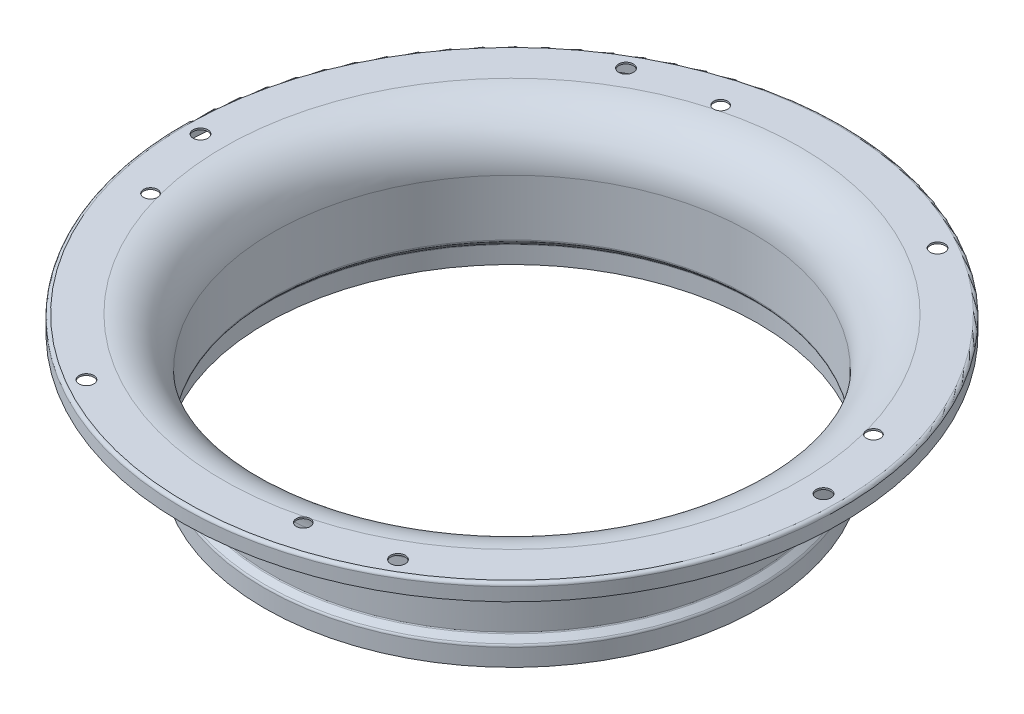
ISO-10303-21;
HEADER;
FILE_DESCRIPTION(('STEP AP214'),'2;1');
FILE_NAME('part.step','',(''),(''),'','','');
FILE_SCHEMA(('AUTOMOTIVE_DESIGN { 1 0 10303 214 1 1 1 1 }'));
ENDSEC;
DATA;
#1=APPLICATION_CONTEXT('core data for automotive mechanical design processes');
#2=APPLICATION_PROTOCOL_DEFINITION('international standard','automotive_design',2000,#1);
#3=PRODUCT_CONTEXT('',#1,'mechanical');
#4=PRODUCT('Part','Part','',(#3));
#5=PRODUCT_RELATED_PRODUCT_CATEGORY('part','',(#4));
#6=PRODUCT_DEFINITION_FORMATION('','',#4);
#7=PRODUCT_DEFINITION_CONTEXT('part definition',#1,'design');
#8=PRODUCT_DEFINITION('design','',#6,#7);
#9=PRODUCT_DEFINITION_SHAPE('','',#8);
#10=(LENGTH_UNIT() NAMED_UNIT(*) SI_UNIT(.MILLI.,.METRE.));
#11=(NAMED_UNIT(*) PLANE_ANGLE_UNIT() SI_UNIT($,.RADIAN.));
#12=(NAMED_UNIT(*) SI_UNIT($,.STERADIAN.) SOLID_ANGLE_UNIT());
#13=UNCERTAINTY_MEASURE_WITH_UNIT(LENGTH_MEASURE(1.E-05),#10,'distance_accuracy_value','');
#14=(GEOMETRIC_REPRESENTATION_CONTEXT(3) GLOBAL_UNCERTAINTY_ASSIGNED_CONTEXT((#13)) GLOBAL_UNIT_ASSIGNED_CONTEXT((#10,
#11,#12)) REPRESENTATION_CONTEXT('',''));
#15=CARTESIAN_POINT('',(0.,0.,0.));
#16=DIRECTION('',(0.,0.,1.));
#17=DIRECTION('',(1.,0.,0.));
#18=AXIS2_PLACEMENT_3D('',#15,#16,#17);
#19=CARTESIAN_POINT('',(-150.,0.,0.));
#20=DIRECTION('',(0.,1.,0.));
#21=DIRECTION('',(0.,0.,1.));
#22=AXIS2_PLACEMENT_3D('',#19,#20,#21);
#23=PLANE('',#22);
#24=CARTESIAN_POINT('',(0.,0.,0.));
#25=DIRECTION('',(0.,-1.,0.));
#26=DIRECTION('',(0.,0.,-1.));
#27=AXIS2_PLACEMENT_3D('',#24,#25,#26);
#28=CIRCLE('',#27,150.);
#29=CARTESIAN_POINT('',(0.,0.,-150.));
#30=VERTEX_POINT('',#29);
#31=EDGE_CURVE('E320',#30,#30,#28,.T.);
#32=ORIENTED_EDGE('',*,*,#31,.F.);
#33=EDGE_LOOP('',(#32));
#34=FACE_BOUND('',#33,.T.);
#35=CARTESIAN_POINT('',(0.,0.,0.));
#36=DIRECTION('',(0.,-1.,0.));
#37=DIRECTION('',(0.,0.,-1.));
#38=AXIS2_PLACEMENT_3D('',#35,#36,#37);
#39=CIRCLE('',#38,151.);
#40=CARTESIAN_POINT('',(0.,0.,-151.));
#41=VERTEX_POINT('',#40);
#42=EDGE_CURVE('E319',#41,#41,#39,.T.);
#43=ORIENTED_EDGE('',*,*,#42,.T.);
#44=EDGE_LOOP('',(#43));
#45=FACE_BOUND('',#44,.T.);
#46=ADVANCED_FACE('F38',(#34,#45),#23,.F.);
#47=CARTESIAN_POINT('',(0.,0.,0.));
#48=DIRECTION('',(0.,-1.,0.));
#49=DIRECTION('',(0.,0.,-1.));
#50=AXIS2_PLACEMENT_3D('',#47,#48,#49);
#51=CYLINDRICAL_SURFACE('',#50,150.);
#52=CARTESIAN_POINT('',(0.,10.5857864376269,0.));
#53=DIRECTION('',(0.,-1.,0.));
#54=DIRECTION('',(0.,0.,-1.));
#55=AXIS2_PLACEMENT_3D('',#52,#53,#54);
#56=CIRCLE('',#55,150.);
#57=CARTESIAN_POINT('',(0.,10.5857864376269,-150.));
#58=VERTEX_POINT('',#57);
#59=EDGE_CURVE('E324',#58,#58,#56,.T.);
#60=ORIENTED_EDGE('',*,*,#59,.F.);
#61=EDGE_LOOP('',(#60));
#62=FACE_BOUND('',#61,.T.);
#63=ORIENTED_EDGE('',*,*,#31,.T.);
#64=EDGE_LOOP('',(#63));
#65=FACE_BOUND('',#64,.T.);
#66=ADVANCED_FACE('F354',(#62,#65),#51,.F.);
#67=CARTESIAN_POINT('',(0.,10.5857864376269,0.));
#68=DIRECTION('',(0.,-1.,0.));
#69=DIRECTION('',(0.,0.,-1.));
#70=AXIS2_PLACEMENT_3D('',#67,#68,#69);
#71=TOROIDAL_SURFACE('',#70,149.,1.);
#72=CARTESIAN_POINT('',(0.,11.2928932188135,0.));
#73=DIRECTION('',(0.,-1.,0.));
#74=DIRECTION('',(0.,0.,-1.));
#75=AXIS2_PLACEMENT_3D('',#72,#73,#74);
#76=CIRCLE('',#75,149.707106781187);
#77=CARTESIAN_POINT('',(0.,11.2928932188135,-149.707106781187));
#78=VERTEX_POINT('',#77);
#79=EDGE_CURVE('E327',#78,#78,#76,.T.);
#80=ORIENTED_EDGE('',*,*,#79,.F.);
#81=EDGE_LOOP('',(#80));
#82=FACE_BOUND('',#81,.T.);
#83=ORIENTED_EDGE('',*,*,#59,.T.);
#84=EDGE_LOOP('',(#83));
#85=FACE_BOUND('',#84,.T.);
#86=ADVANCED_FACE('F348',(#82,#85),#71,.F.);
#87=CARTESIAN_POINT('',(0.,11.2928932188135,0.));
#88=DIRECTION('',(0.,-1.,0.));
#89=DIRECTION('',(0.,0.,-1.));
#90=AXIS2_PLACEMENT_3D('',#87,#88,#89);
#91=CONICAL_SURFACE('',#90,149.707106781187,0.785398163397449);
#92=CARTESIAN_POINT('',(0.,14.4142135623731,0.));
#93=DIRECTION('',(0.,-1.,0.));
#94=DIRECTION('',(0.,0.,-1.));
#95=AXIS2_PLACEMENT_3D('',#92,#93,#94);
#96=CIRCLE('',#95,146.585786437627);
#97=CARTESIAN_POINT('',(0.,14.4142135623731,-146.585786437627));
#98=VERTEX_POINT('',#97);
#99=EDGE_CURVE('E331',#98,#98,#96,.T.);
#100=ORIENTED_EDGE('',*,*,#99,.F.);
#101=EDGE_LOOP('',(#100));
#102=FACE_BOUND('',#101,.T.);
#103=ORIENTED_EDGE('',*,*,#79,.T.);
#104=EDGE_LOOP('',(#103));
#105=FACE_BOUND('',#104,.T.);
#106=ADVANCED_FACE('F343',(#102,#105),#91,.F.);
#107=CARTESIAN_POINT('',(0.,15.8284271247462,0.));
#108=DIRECTION('',(0.,-1.,0.));
#109=DIRECTION('',(0.,0.,-1.));
#110=AXIS2_PLACEMENT_3D('',#107,#108,#109);
#111=TOROIDAL_SURFACE('',#110,148.,2.);
#112=CARTESIAN_POINT('',(0.,15.8284271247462,0.));
#113=DIRECTION('',(0.,-1.,0.));
#114=DIRECTION('',(0.,0.,-1.));
#115=AXIS2_PLACEMENT_3D('',#112,#113,#114);
#116=CIRCLE('',#115,146.);
#117=CARTESIAN_POINT('',(0.,15.8284271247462,-146.));
#118=VERTEX_POINT('',#117);
#119=EDGE_CURVE('E133',#118,#118,#116,.T.);
#120=ORIENTED_EDGE('',*,*,#119,.F.);
#121=EDGE_LOOP('',(#120));
#122=FACE_BOUND('',#121,.T.);
#123=ORIENTED_EDGE('',*,*,#99,.T.);
#124=EDGE_LOOP('',(#123));
#125=FACE_BOUND('',#124,.T.);
#126=ADVANCED_FACE('F340',(#122,#125),#111,.T.);
#127=CARTESIAN_POINT('',(0.,0.,0.));
#128=DIRECTION('',(0.,-1.,0.));
#129=DIRECTION('',(0.,0.,-1.));
#130=AXIS2_PLACEMENT_3D('',#127,#128,#129);
#131=CYLINDRICAL_SURFACE('',#130,146.);
#132=CARTESIAN_POINT('',(0.,50.,0.));
#133=DIRECTION('',(0.,-1.,0.));
#134=DIRECTION('',(0.,0.,-1.));
#135=AXIS2_PLACEMENT_3D('',#132,#133,#134);
#136=CIRCLE('',#135,146.);
#137=CARTESIAN_POINT('',(0.,50.,-146.));
#138=VERTEX_POINT('',#137);
#139=EDGE_CURVE('E127',#138,#138,#136,.T.);
#140=ORIENTED_EDGE('',*,*,#139,.F.);
#141=EDGE_LOOP('',(#140));
#142=FACE_BOUND('',#141,.T.);
#143=ORIENTED_EDGE('',*,*,#119,.T.);
#144=EDGE_LOOP('',(#143));
#145=FACE_BOUND('',#144,.T.);
#146=ADVANCED_FACE('F187',(#142,#145),#131,.F.);
#147=CARTESIAN_POINT('',(0.,50.,0.));
#148=DIRECTION('',(0.,-1.,0.));
#149=DIRECTION('',(0.,0.,-1.));
#150=AXIS2_PLACEMENT_3D('',#147,#148,#149);
#151=TOROIDAL_SURFACE('',#150,176.,30.);
#152=CARTESIAN_POINT('',(0.,80.,0.));
#153=DIRECTION('',(0.,-1.,0.));
#154=DIRECTION('',(0.,0.,-1.));
#155=AXIS2_PLACEMENT_3D('',#152,#153,#154);
#156=CIRCLE('',#155,176.);
#157=CARTESIAN_POINT('',(-170.364955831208,80.,44.1789749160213));
#158=VERTEX_POINT('',#157);
#159=CARTESIAN_POINT('',(-46.922363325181,80.,-169.629867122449));
#160=VERTEX_POINT('',#159);
#161=EDGE_CURVE('E118',#158,#160,#156,.T.);
#162=ORIENTED_EDGE('',*,*,#161,.F.);
#163=CARTESIAN_POINT('',(-169.629867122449,80.,46.9223633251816));
#164=CARTESIAN_POINT('',(-169.625590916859,79.9999935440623,46.8682749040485));
#165=CARTESIAN_POINT('',(-169.622351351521,79.9999692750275,46.8141076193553));
#166=CARTESIAN_POINT('',(-169.618648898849,79.9999118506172,46.7229454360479));
#167=CARTESIAN_POINT('',(-169.617630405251,79.9998839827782,46.6859726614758));
#168=CARTESIAN_POINT('',(-169.616463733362,79.9998187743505,46.6054426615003));
#169=CARTESIAN_POINT('',(-169.616502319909,79.999780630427,46.561882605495));
#170=CARTESIAN_POINT('',(-169.618025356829,79.9996943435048,46.4682143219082));
#171=CARTESIAN_POINT('',(-169.619727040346,79.999645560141,46.4181095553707));
#172=CARTESIAN_POINT('',(-169.625241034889,79.9995368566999,46.3114295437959));
#173=CARTESIAN_POINT('',(-169.629300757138,79.9994763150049,46.2548670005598));
#174=CARTESIAN_POINT('',(-169.640141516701,79.9993506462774,46.1369306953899));
#175=CARTESIAN_POINT('',(-169.647132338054,79.9992855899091,46.075576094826));
#176=CARTESIAN_POINT('',(-169.662616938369,79.9991726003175,45.9617783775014));
#177=CARTESIAN_POINT('',(-169.670764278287,79.9991235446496,45.9092878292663));
#178=CARTESIAN_POINT('',(-169.687537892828,79.9990426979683,45.8131468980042));
#179=CARTESIAN_POINT('',(-169.695871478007,79.9990093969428,45.76944533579));
#180=CARTESIAN_POINT('',(-169.712157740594,79.9989567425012,45.6907730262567));
#181=CARTESIAN_POINT('',(-169.719870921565,79.9989359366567,45.6557525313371));
#182=CARTESIAN_POINT('',(-169.738450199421,79.9989154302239,45.5762022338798));
#183=CARTESIAN_POINT('',(-169.749596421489,79.9989232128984,45.5317378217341));
#184=CARTESIAN_POINT('',(-169.782278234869,79.9990199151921,45.4097666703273));
#185=CARTESIAN_POINT('',(-169.805305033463,79.9991656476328,45.3326542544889));
#186=CARTESIAN_POINT('',(-169.855696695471,79.9993875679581,45.1798643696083));
#187=CARTESIAN_POINT('',(-169.883061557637,79.9994637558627,45.1041869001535));
#188=CARTESIAN_POINT('',(-169.942042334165,79.9996103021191,44.9545059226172));
#189=CARTESIAN_POINT('',(-169.973658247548,79.9996806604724,44.8805024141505));
#190=CARTESIAN_POINT('',(-170.041038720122,79.9997984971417,44.7344091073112));
#191=CARTESIAN_POINT('',(-170.076803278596,79.9998459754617,44.6623193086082));
#192=CARTESIAN_POINT('',(-170.152366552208,79.9999225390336,44.5202858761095));
#193=CARTESIAN_POINT('',(-170.192165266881,79.9999516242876,44.4503422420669));
#194=CARTESIAN_POINT('',(-170.275665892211,79.9999905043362,44.3128250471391));
#195=CARTESIAN_POINT('',(-170.319367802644,80.0000002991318,44.2452514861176));
#196=CARTESIAN_POINT('',(-170.364955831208,80.,44.1789749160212));
#197=B_SPLINE_CURVE_WITH_KNOTS('',3,(#163,#164,#165,#166,#167,#168,#169,#170,#171,#172,#173,
#174,#175,#176,#177,#178,#179,#180,#181,#182,#183,#184,#185,#186,#187,#188,#189,#190,#191,#192,
#193,#194,#195,#196),.UNSPECIFIED.,.F.,.F.,(4,2,2,2,2,2,2,2,2,2,2,2,2,2,2,2,4),(0.,
0.162754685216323,0.273703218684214,0.404362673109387,0.5547323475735,0.724811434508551,
0.910005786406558,1.06932621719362,1.2027712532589,1.31033966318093,1.44783856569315,
1.6891308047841,1.93042297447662,2.17171508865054,2.41300716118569,2.65429920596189,
2.89559123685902),.UNSPECIFIED.);
#198=CARTESIAN_POINT('',(-169.629867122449,80.,46.9223633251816));
#199=VERTEX_POINT('',#198);
#200=EDGE_CURVE('E56',#199,#158,#197,.T.);
#201=ORIENTED_EDGE('',*,*,#200,.F.);
#202=CARTESIAN_POINT('',(44.1789749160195,80.,170.364955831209));
#203=VERTEX_POINT('',#202);
#204=EDGE_CURVE('E116',#203,#199,#156,.T.);
#205=ORIENTED_EDGE('',*,*,#204,.F.);
#206=CARTESIAN_POINT('',(46.9223633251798,80.,169.629867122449));
#207=CARTESIAN_POINT('',(46.8682749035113,79.9999935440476,169.625590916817));
#208=CARTESIAN_POINT('',(46.8141076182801,79.999969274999,169.622351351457));
#209=CARTESIAN_POINT('',(46.7229454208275,79.9999118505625,169.618648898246));
#210=CARTESIAN_POINT('',(46.6859726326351,79.9998839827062,169.617630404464));
#211=CARTESIAN_POINT('',(46.6054425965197,79.9998187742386,169.616463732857));
#212=CARTESIAN_POINT('',(46.5618825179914,79.9997806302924,169.616502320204));
#213=CARTESIAN_POINT('',(46.4682141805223,79.9996943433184,169.618025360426));
#214=CARTESIAN_POINT('',(46.4181093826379,79.9996455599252,169.619727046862));
#215=CARTESIAN_POINT('',(46.3114292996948,79.9995368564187,169.625241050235));
#216=CARTESIAN_POINT('',(46.2548667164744,79.9994763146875,169.629300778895));
#217=CARTESIAN_POINT('',(46.1369304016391,79.9993506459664,169.640141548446));
#218=CARTESIAN_POINT('',(46.0755758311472,79.9992855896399,169.647132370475));
#219=CARTESIAN_POINT('',(45.9617781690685,79.9991726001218,169.662616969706));
#220=CARTESIAN_POINT('',(45.9092876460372,79.9991235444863,169.670764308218));
#221=CARTESIAN_POINT('',(45.8131467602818,79.9990426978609,169.687537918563));
#222=CARTESIAN_POINT('',(45.7694452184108,79.9990093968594,169.695871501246));
#223=CARTESIAN_POINT('',(45.690772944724,79.9989567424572,169.712157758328));
#224=CARTESIAN_POINT('',(45.6557524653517,79.9989359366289,169.719870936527));
#225=CARTESIAN_POINT('',(45.576202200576,79.9989154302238,169.738450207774));
#226=CARTESIAN_POINT('',(45.53173780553,79.9989232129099,169.749596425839));
#227=CARTESIAN_POINT('',(45.4097666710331,79.9990199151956,169.782278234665));
#228=CARTESIAN_POINT('',(45.3326542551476,79.9991656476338,169.805305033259));
#229=CARTESIAN_POINT('',(45.179864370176,79.9993875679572,169.855696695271));
#230=CARTESIAN_POINT('',(45.1041869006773,79.9994637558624,169.883061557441));
#231=CARTESIAN_POINT('',(44.9545059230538,79.9996103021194,169.942042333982));
#232=CARTESIAN_POINT('',(44.8805024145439,79.9996806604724,169.973658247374));
#233=CARTESIAN_POINT('',(44.7344091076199,79.9997984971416,170.041038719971));
#234=CARTESIAN_POINT('',(44.6623193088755,79.9998459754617,170.076803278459));
#235=CARTESIAN_POINT('',(44.520285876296,79.9999225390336,170.152366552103));
#236=CARTESIAN_POINT('',(44.450342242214,79.9999516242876,170.192165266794));
#237=CARTESIAN_POINT('',(44.3128250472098,79.9999905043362,170.275665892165));
#238=CARTESIAN_POINT('',(44.2452514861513,80.0000002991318,170.31936780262));
#239=CARTESIAN_POINT('',(44.1789749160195,80.,170.364955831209));
#240=B_SPLINE_CURVE_WITH_KNOTS('',3,(#206,#207,#208,#209,#210,#211,#212,#213,#214,#215,#216,
#217,#218,#219,#220,#221,#222,#223,#224,#225,#226,#227,#228,#229,#230,#231,#232,#233,#234,#235,
#236,#237,#238,#239),.UNSPECIFIED.,.F.,.F.,(4,2,2,2,2,2,2,2,2,2,2,2,2,2,2,2,4),(0.,
0.162754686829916,0.273703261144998,0.404362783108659,0.554732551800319,0.72481175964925,
0.910006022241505,1.0693263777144,1.20277135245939,1.3103397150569,1.44783856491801,
1.68913080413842,1.9304229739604,2.17171508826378,2.41300716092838,2.65429920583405,
2.89559123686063),.UNSPECIFIED.);
#241=CARTESIAN_POINT('',(46.9223633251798,80.,169.629867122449));
#242=VERTEX_POINT('',#241);
#243=EDGE_CURVE('E275',#242,#203,#240,.T.);
#244=ORIENTED_EDGE('',*,*,#243,.F.);
#245=CARTESIAN_POINT('',(170.364955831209,80.,-44.1789749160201));
#246=VERTEX_POINT('',#245);
#247=EDGE_CURVE('E158',#246,#242,#156,.T.);
#248=ORIENTED_EDGE('',*,*,#247,.F.);
#249=CARTESIAN_POINT('',(169.629867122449,80.,-46.9223633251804));
#250=CARTESIAN_POINT('',(169.625590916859,79.9999935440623,-46.8682749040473));
#251=CARTESIAN_POINT('',(169.622351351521,79.9999692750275,-46.8141076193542));
#252=CARTESIAN_POINT('',(169.618648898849,79.9999118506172,-46.7229454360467));
#253=CARTESIAN_POINT('',(169.617630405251,79.9998839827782,-46.6859726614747));
#254=CARTESIAN_POINT('',(169.616463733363,79.9998187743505,-46.6054426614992));
#255=CARTESIAN_POINT('',(169.616502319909,79.999780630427,-46.5618826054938));
#256=CARTESIAN_POINT('',(169.61802535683,79.9996943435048,-46.4682143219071));
#257=CARTESIAN_POINT('',(169.619727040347,79.999645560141,-46.4181095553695));
#258=CARTESIAN_POINT('',(169.625241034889,79.9995368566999,-46.3114295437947));
#259=CARTESIAN_POINT('',(169.629300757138,79.9994763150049,-46.2548670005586));
#260=CARTESIAN_POINT('',(169.640141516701,79.9993506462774,-46.1369306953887));
#261=CARTESIAN_POINT('',(169.647132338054,79.9992855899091,-46.0755760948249));
#262=CARTESIAN_POINT('',(169.662616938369,79.9991726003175,-45.9617783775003));
#263=CARTESIAN_POINT('',(169.670764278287,79.9991235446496,-45.9092878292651));
#264=CARTESIAN_POINT('',(169.687537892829,79.9990426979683,-45.813146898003));
#265=CARTESIAN_POINT('',(169.695871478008,79.9990093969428,-45.7694453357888));
#266=CARTESIAN_POINT('',(169.712157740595,79.9989567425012,-45.6907730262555));
#267=CARTESIAN_POINT('',(169.719870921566,79.9989359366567,-45.6557525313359));
#268=CARTESIAN_POINT('',(169.738450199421,79.9989154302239,-45.5762022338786));
#269=CARTESIAN_POINT('',(169.749596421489,79.9989232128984,-45.5317378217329));
#270=CARTESIAN_POINT('',(169.782278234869,79.9990199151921,-45.4097666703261));
#271=CARTESIAN_POINT('',(169.805305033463,79.9991656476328,-45.3326542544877));
#272=CARTESIAN_POINT('',(169.855696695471,79.9993875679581,-45.1798643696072));
#273=CARTESIAN_POINT('',(169.883061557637,79.9994637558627,-45.1041869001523));
#274=CARTESIAN_POINT('',(169.942042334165,79.9996103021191,-44.954505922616));
#275=CARTESIAN_POINT('',(169.973658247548,79.9996806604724,-44.8805024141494));
#276=CARTESIAN_POINT('',(170.041038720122,79.9997984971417,-44.73440910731));
#277=CARTESIAN_POINT('',(170.076803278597,79.9998459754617,-44.6623193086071));
#278=CARTESIAN_POINT('',(170.152366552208,79.9999225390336,-44.5202858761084));
#279=CARTESIAN_POINT('',(170.192165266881,79.9999516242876,-44.4503422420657));
#280=CARTESIAN_POINT('',(170.275665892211,79.9999905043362,-44.3128250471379));
#281=CARTESIAN_POINT('',(170.319367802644,80.0000002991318,-44.2452514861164));
#282=CARTESIAN_POINT('',(170.364955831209,80.,-44.1789749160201));
#283=B_SPLINE_CURVE_WITH_KNOTS('',3,(#249,#250,#251,#252,#253,#254,#255,#256,#257,#258,#259,
#260,#261,#262,#263,#264,#265,#266,#267,#268,#269,#270,#271,#272,#273,#274,#275,#276,#277,#278,
#279,#280,#281,#282),.UNSPECIFIED.,.F.,.F.,(4,2,2,2,2,2,2,2,2,2,2,2,2,2,2,2,4),(0.,
0.162754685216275,0.273703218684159,0.404362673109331,0.554732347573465,0.724811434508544,
0.910005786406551,1.06932621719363,1.20277125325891,1.31033966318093,1.44783856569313,
1.68913080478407,1.93042297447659,2.1717150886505,2.41300716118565,2.65429920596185,
2.89559123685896),.UNSPECIFIED.);
#284=CARTESIAN_POINT('',(169.629867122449,80.,-46.9223633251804));
#285=VERTEX_POINT('',#284);
#286=EDGE_CURVE('E202',#285,#246,#283,.T.);
#287=ORIENTED_EDGE('',*,*,#286,.F.);
#288=CARTESIAN_POINT('',(-44.1789749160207,80.,-170.364955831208));
#289=VERTEX_POINT('',#288);
#290=EDGE_CURVE('E136',#289,#285,#156,.T.);
#291=ORIENTED_EDGE('',*,*,#290,.F.);
#292=CARTESIAN_POINT('',(-46.922363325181,80.,-169.629867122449));
#293=CARTESIAN_POINT('',(-46.8456875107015,80.0000034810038,-169.623805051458));
#294=CARTESIAN_POINT('',(-46.768863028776,79.999966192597,-169.619827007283));
#295=CARTESIAN_POINT('',(-46.6571428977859,79.9998861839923,-169.617077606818));
#296=CARTESIAN_POINT('',(-46.6222858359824,79.9998575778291,-169.61664872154));
#297=CARTESIAN_POINT('',(-46.5424860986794,79.9997886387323,-169.616648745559));
#298=CARTESIAN_POINT('',(-46.4975429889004,79.9997473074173,-169.617361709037));
#299=CARTESIAN_POINT('',(-46.410595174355,79.9996691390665,-169.620120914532));
#300=CARTESIAN_POINT('',(-46.3685875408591,79.9996321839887,-169.622078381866));
#301=CARTESIAN_POINT('',(-46.2637300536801,79.9995400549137,-169.628525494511));
#302=CARTESIAN_POINT('',(-46.2009259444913,79.9994849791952,-169.633790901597));
#303=CARTESIAN_POINT('',(-46.0834358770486,79.9993833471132,-169.646277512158));
#304=CARTESIAN_POINT('',(-46.0287148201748,79.9993365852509,-169.653172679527));
#305=CARTESIAN_POINT('',(-45.9273626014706,79.999251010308,-169.667952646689));
#306=CARTESIAN_POINT('',(-45.8806904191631,79.9992120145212,-169.675556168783));
#307=CARTESIAN_POINT('',(-45.7953659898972,79.999143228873,-169.690922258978));
#308=CARTESIAN_POINT('',(-45.7566707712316,79.9991129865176,-169.698448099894));
#309=CARTESIAN_POINT('',(-45.6640099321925,79.9990403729,-169.71781153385));
#310=CARTESIAN_POINT('',(-45.6101508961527,79.9989980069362,-169.73016712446));
#311=CARTESIAN_POINT('',(-45.5334766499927,79.9989608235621,-169.749337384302));
#312=CARTESIAN_POINT('',(-45.5104445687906,79.9989526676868,-169.755301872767));
#313=CARTESIAN_POINT('',(-45.4097703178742,79.9989774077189,-169.782277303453));
#314=CARTESIAN_POINT('',(-45.3326552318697,79.9991542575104,-169.805304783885));
#315=CARTESIAN_POINT('',(-45.1798633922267,79.9993989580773,-169.855696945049));
#316=CARTESIAN_POINT('',(-45.1041866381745,79.9994668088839,-169.883061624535));
#317=CARTESIAN_POINT('',(-44.9545061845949,79.9996072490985,-169.942042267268));
#318=CARTESIAN_POINT('',(-44.8805024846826,79.9996798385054,-169.973658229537));
#319=CARTESIAN_POINT('',(-44.734409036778,79.9997993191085,-170.041038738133));
#320=CARTESIAN_POINT('',(-44.6623192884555,79.9998462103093,-170.076803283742));
#321=CARTESIAN_POINT('',(-44.5202858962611,79.9999223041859,-170.152366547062));
#322=CARTESIAN_POINT('',(-44.4503422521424,79.9999515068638,-170.192165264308));
#323=CARTESIAN_POINT('',(-44.3128250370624,79.99999062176,-170.275665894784));
#324=CARTESIAN_POINT('',(-44.2452514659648,80.0000005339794,-170.31936780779));
#325=CARTESIAN_POINT('',(-44.1789749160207,80.,-170.364955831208));
#326=B_SPLINE_CURVE_WITH_KNOTS('',3,(#292,#293,#294,#295,#296,#297,#298,#299,#300,#301,#302,
#303,#304,#305,#306,#307,#308,#309,#310,#311,#312,#313,#314,#315,#316,#317,#318,#319,#320,#321,
#322,#323,#324,#325),.UNSPECIFIED.,.F.,.F.,(4,2,2,2,2,2,2,2,2,2,2,2,2,2,2,2,4),(0.,
0.230682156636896,0.335251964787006,0.470073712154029,0.596217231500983,0.785222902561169,
0.950643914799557,1.09247899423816,1.21072704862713,1.37645090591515,1.44782526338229,
1.68911750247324,1.93040967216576,2.17170178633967,2.41299385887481,2.65428590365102,
2.89557793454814),.UNSPECIFIED.);
#327=EDGE_CURVE('E171',#160,#289,#326,.T.);
#328=ORIENTED_EDGE('',*,*,#327,.F.);
#329=EDGE_LOOP('',(#162,#201,#205,#244,#248,#287,#291,#328));
#330=FACE_BOUND('',#329,.T.);
#331=ORIENTED_EDGE('',*,*,#139,.T.);
#332=EDGE_LOOP('',(#331));
#333=FACE_BOUND('',#332,.T.);
#334=ADVANCED_FACE('F113',(#330,#333),#151,.T.);
#335=CARTESIAN_POINT('',(-176.,80.,0.));
#336=DIRECTION('',(0.,-1.,0.));
#337=DIRECTION('',(0.,0.,-1.));
#338=AXIS2_PLACEMENT_3D('',#335,#336,#337);
#339=PLANE('',#338);
#340=CARTESIAN_POINT('',(-95.0000000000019,80.,-164.544826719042));
#341=DIRECTION('',(0.,1.,0.));
#342=DIRECTION('',(0.,0.,1.));
#343=AXIS2_PLACEMENT_3D('',#340,#341,#342);
#344=CIRCLE('',#343,4.49999999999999);
#345=CARTESIAN_POINT('',(-95.0000000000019,80.,-160.044826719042));
#346=VERTEX_POINT('',#345);
#347=EDGE_CURVE('E270',#346,#346,#344,.T.);
#348=ORIENTED_EDGE('',*,*,#347,.F.);
#349=EDGE_LOOP('',(#348));
#350=FACE_BOUND('',#349,.T.);
#351=CARTESIAN_POINT('',(94.9999999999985,80.,-164.544826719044));
#352=DIRECTION('',(0.,1.,0.));
#353=DIRECTION('',(0.,0.,1.));
#354=AXIS2_PLACEMENT_3D('',#351,#352,#353);
#355=CIRCLE('',#354,4.49999999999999);
#356=CARTESIAN_POINT('',(94.9999999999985,80.,-160.044826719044));
#357=VERTEX_POINT('',#356);
#358=EDGE_CURVE('E288',#357,#357,#355,.T.);
#359=ORIENTED_EDGE('',*,*,#358,.F.);
#360=EDGE_LOOP('',(#359));
#361=FACE_BOUND('',#360,.T.);
#362=CARTESIAN_POINT('',(190.,80.,-1.32676367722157E-12));
#363=DIRECTION('',(0.,1.,0.));
#364=DIRECTION('',(0.,0.,1.));
#365=AXIS2_PLACEMENT_3D('',#362,#363,#364);
#366=CIRCLE('',#365,4.5);
#367=CARTESIAN_POINT('',(190.,80.,4.49999999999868));
#368=VERTEX_POINT('',#367);
#369=EDGE_CURVE('E300',#368,#368,#366,.T.);
#370=ORIENTED_EDGE('',*,*,#369,.F.);
#371=EDGE_LOOP('',(#370));
#372=FACE_BOUND('',#371,.T.);
#373=CARTESIAN_POINT('',(95.0000000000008,80.,164.544826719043));
#374=DIRECTION('',(0.,1.,0.));
#375=DIRECTION('',(0.,0.,1.));
#376=AXIS2_PLACEMENT_3D('',#373,#374,#375);
#377=CIRCLE('',#376,4.49999999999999);
#378=CARTESIAN_POINT('',(95.0000000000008,80.,169.044826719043));
#379=VERTEX_POINT('',#378);
#380=EDGE_CURVE('E304',#379,#379,#377,.T.);
#381=ORIENTED_EDGE('',*,*,#380,.F.);
#382=EDGE_LOOP('',(#381));
#383=FACE_BOUND('',#382,.T.);
#384=CARTESIAN_POINT('',(-94.9999999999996,80.,164.544826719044));
#385=DIRECTION('',(0.,1.,0.));
#386=DIRECTION('',(0.,0.,1.));
#387=AXIS2_PLACEMENT_3D('',#384,#385,#386);
#388=CIRCLE('',#387,4.49999999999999);
#389=CARTESIAN_POINT('',(-94.9999999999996,80.,169.044826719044));
#390=VERTEX_POINT('',#389);
#391=EDGE_CURVE('E309',#390,#390,#388,.T.);
#392=ORIENTED_EDGE('',*,*,#391,.F.);
#393=EDGE_LOOP('',(#392));
#394=FACE_BOUND('',#393,.T.);
#395=CARTESIAN_POINT('',(-190.,80.,0.));
#396=DIRECTION('',(0.,1.,0.));
#397=DIRECTION('',(0.,0.,1.));
#398=AXIS2_PLACEMENT_3D('',#395,#396,#397);
#399=CIRCLE('',#398,4.5);
#400=CARTESIAN_POINT('',(-190.,80.,4.5));
#401=VERTEX_POINT('',#400);
#402=EDGE_CURVE('E314',#401,#401,#399,.T.);
#403=ORIENTED_EDGE('',*,*,#402,.F.);
#404=EDGE_LOOP('',(#403));
#405=FACE_BOUND('',#404,.T.);
#406=CARTESIAN_POINT('',(0.,80.,0.));
#407=DIRECTION('',(0.,-1.,0.));
#408=DIRECTION('',(0.,0.,-1.));
#409=AXIS2_PLACEMENT_3D('',#406,#407,#408);
#410=CIRCLE('',#409,199.);
#411=CARTESIAN_POINT('',(0.,80.,-199.));
#412=VERTEX_POINT('',#411);
#413=EDGE_CURVE('E152',#412,#412,#410,.T.);
#414=ORIENTED_EDGE('',*,*,#413,.F.);
#415=EDGE_LOOP('',(#414));
#416=FACE_BOUND('',#415,.T.);
#417=ORIENTED_EDGE('',*,*,#204,.T.);
#418=CARTESIAN_POINT('',(-173.866648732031,80.,46.5874281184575));
#419=DIRECTION('',(0.,1.,0.));
#420=DIRECTION('',(0.,0.,1.));
#421=AXIS2_PLACEMENT_3D('',#418,#419,#420);
#422=CIRCLE('',#421,4.25);
#423=EDGE_CURVE('E104',#158,#199,#422,.T.);
#424=ORIENTED_EDGE('',*,*,#423,.F.);
#425=ORIENTED_EDGE('',*,*,#161,.T.);
#426=CARTESIAN_POINT('',(-46.5874281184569,80.,-173.866648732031));
#427=DIRECTION('',(0.,1.,0.));
#428=DIRECTION('',(0.,0.,1.));
#429=AXIS2_PLACEMENT_3D('',#426,#427,#428);
#430=CIRCLE('',#429,4.24999999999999);
#431=EDGE_CURVE('E120',#289,#160,#430,.T.);
#432=ORIENTED_EDGE('',*,*,#431,.F.);
#433=ORIENTED_EDGE('',*,*,#290,.T.);
#434=CARTESIAN_POINT('',(173.866648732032,80.,-46.5874281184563));
#435=DIRECTION('',(0.,1.,0.));
#436=DIRECTION('',(0.,0.,1.));
#437=AXIS2_PLACEMENT_3D('',#434,#435,#436);
#438=CIRCLE('',#437,4.25);
#439=EDGE_CURVE('E216',#246,#285,#438,.T.);
#440=ORIENTED_EDGE('',*,*,#439,.F.);
#441=ORIENTED_EDGE('',*,*,#247,.T.);
#442=CARTESIAN_POINT('',(46.5874281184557,80.,173.866648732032));
#443=DIRECTION('',(0.,1.,0.));
#444=DIRECTION('',(0.,0.,1.));
#445=AXIS2_PLACEMENT_3D('',#442,#443,#444);
#446=CIRCLE('',#445,4.24999999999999);
#447=EDGE_CURVE('E125',#203,#242,#446,.T.);
#448=ORIENTED_EDGE('',*,*,#447,.F.);
#449=EDGE_LOOP('',(#417,#424,#425,#432,#433,#440,#441,#448));
#450=FACE_BOUND('',#449,.T.);
#451=ADVANCED_FACE('F123',(#350,#361,#372,#383,#394,#405,#416,#450),#339,.F.);
#452=CARTESIAN_POINT('',(0.,78.,0.));
#453=DIRECTION('',(0.,-1.,0.));
#454=DIRECTION('',(0.,0.,-1.));
#455=AXIS2_PLACEMENT_3D('',#452,#453,#454);
#456=TOROIDAL_SURFACE('',#455,199.,2.);
#457=CARTESIAN_POINT('',(0.,78.,0.));
#458=DIRECTION('',(0.,-1.,0.));
#459=DIRECTION('',(0.,0.,-1.));
#460=AXIS2_PLACEMENT_3D('',#457,#458,#459);
#461=CIRCLE('',#460,201.);
#462=CARTESIAN_POINT('',(0.,78.,-201.));
#463=VERTEX_POINT('',#462);
#464=EDGE_CURVE('E411',#463,#463,#461,.T.);
#465=ORIENTED_EDGE('',*,*,#464,.F.);
#466=EDGE_LOOP('',(#465));
#467=FACE_BOUND('',#466,.T.);
#468=ORIENTED_EDGE('',*,*,#413,.T.);
#469=EDGE_LOOP('',(#468));
#470=FACE_BOUND('',#469,.T.);
#471=ADVANCED_FACE('F473',(#467,#470),#456,.T.);
#472=CARTESIAN_POINT('',(0.,0.,0.));
#473=DIRECTION('',(0.,-1.,0.));
#474=DIRECTION('',(0.,0.,-1.));
#475=AXIS2_PLACEMENT_3D('',#472,#473,#474);
#476=CYLINDRICAL_SURFACE('',#475,201.);
#477=CARTESIAN_POINT('',(0.,70.,0.));
#478=DIRECTION('',(0.,-1.,0.));
#479=DIRECTION('',(0.,0.,-1.));
#480=AXIS2_PLACEMENT_3D('',#477,#478,#479);
#481=CIRCLE('',#480,201.);
#482=CARTESIAN_POINT('',(0.,70.,-201.));
#483=VERTEX_POINT('',#482);
#484=EDGE_CURVE('E409',#483,#483,#481,.T.);
#485=ORIENTED_EDGE('',*,*,#484,.F.);
#486=EDGE_LOOP('',(#485));
#487=FACE_BOUND('',#486,.T.);
#488=ORIENTED_EDGE('',*,*,#464,.T.);
#489=EDGE_LOOP('',(#488));
#490=FACE_BOUND('',#489,.T.);
#491=ADVANCED_FACE('F513',(#487,#490),#476,.T.);
#492=CARTESIAN_POINT('',(-201.,70.,0.));
#493=DIRECTION('',(0.,1.,0.));
#494=DIRECTION('',(0.,0.,1.));
#495=AXIS2_PLACEMENT_3D('',#492,#493,#494);
#496=PLANE('',#495);
#497=CARTESIAN_POINT('',(0.,70.,0.));
#498=DIRECTION('',(0.,-1.,0.));
#499=DIRECTION('',(0.,0.,-1.));
#500=AXIS2_PLACEMENT_3D('',#497,#498,#499);
#501=CIRCLE('',#500,200.);
#502=CARTESIAN_POINT('',(0.,70.,-200.));
#503=VERTEX_POINT('',#502);
#504=EDGE_CURVE('E405',#503,#503,#501,.T.);
#505=ORIENTED_EDGE('',*,*,#504,.F.);
#506=EDGE_LOOP('',(#505));
#507=FACE_BOUND('',#506,.T.);
#508=ORIENTED_EDGE('',*,*,#484,.T.);
#509=EDGE_LOOP('',(#508));
#510=FACE_BOUND('',#509,.T.);
#511=ADVANCED_FACE('F509',(#507,#510),#496,.F.);
#512=CARTESIAN_POINT('',(0.,0.,0.));
#513=DIRECTION('',(0.,-1.,0.));
#514=DIRECTION('',(0.,0.,-1.));
#515=AXIS2_PLACEMENT_3D('',#512,#513,#514);
#516=CYLINDRICAL_SURFACE('',#515,200.);
#517=CARTESIAN_POINT('',(0.,78.,0.));
#518=DIRECTION('',(0.,-1.,0.));
#519=DIRECTION('',(0.,0.,-1.));
#520=AXIS2_PLACEMENT_3D('',#517,#518,#519);
#521=CIRCLE('',#520,200.);
#522=CARTESIAN_POINT('',(0.,78.,-200.));
#523=VERTEX_POINT('',#522);
#524=EDGE_CURVE('E401',#523,#523,#521,.T.);
#525=ORIENTED_EDGE('',*,*,#524,.F.);
#526=EDGE_LOOP('',(#525));
#527=FACE_BOUND('',#526,.T.);
#528=ORIENTED_EDGE('',*,*,#504,.T.);
#529=EDGE_LOOP('',(#528));
#530=FACE_BOUND('',#529,.T.);
#531=ADVANCED_FACE('F500',(#527,#530),#516,.F.);
#532=CARTESIAN_POINT('',(0.,78.,0.));
#533=DIRECTION('',(0.,-1.,0.));
#534=DIRECTION('',(0.,0.,-1.));
#535=AXIS2_PLACEMENT_3D('',#532,#533,#534);
#536=TOROIDAL_SURFACE('',#535,199.,1.);
#537=CARTESIAN_POINT('',(0.,79.,0.));
#538=DIRECTION('',(0.,-1.,0.));
#539=DIRECTION('',(0.,0.,-1.));
#540=AXIS2_PLACEMENT_3D('',#537,#538,#539);
#541=CIRCLE('',#540,199.);
#542=CARTESIAN_POINT('',(0.,79.,-199.));
#543=VERTEX_POINT('',#542);
#544=EDGE_CURVE('E396',#543,#543,#541,.T.);
#545=ORIENTED_EDGE('',*,*,#544,.F.);
#546=EDGE_LOOP('',(#545));
#547=FACE_BOUND('',#546,.T.);
#548=ORIENTED_EDGE('',*,*,#524,.T.);
#549=EDGE_LOOP('',(#548));
#550=FACE_BOUND('',#549,.T.);
#551=ADVANCED_FACE('F492',(#547,#550),#536,.F.);
#552=CARTESIAN_POINT('',(-176.,79.,0.));
#553=DIRECTION('',(0.,1.,0.));
#554=DIRECTION('',(0.,0.,1.));
#555=AXIS2_PLACEMENT_3D('',#552,#553,#554);
#556=PLANE('',#555);
#557=CARTESIAN_POINT('',(-95.0000000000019,79.,-164.544826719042));
#558=DIRECTION('',(0.,1.,0.));
#559=DIRECTION('',(0.,0.,1.));
#560=AXIS2_PLACEMENT_3D('',#557,#558,#559);
#561=CIRCLE('',#560,4.49999999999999);
#562=CARTESIAN_POINT('',(-95.0000000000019,79.,-160.044826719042));
#563=VERTEX_POINT('',#562);
#564=EDGE_CURVE('E283',#563,#563,#561,.T.);
#565=ORIENTED_EDGE('',*,*,#564,.T.);
#566=EDGE_LOOP('',(#565));
#567=FACE_BOUND('',#566,.T.);
#568=CARTESIAN_POINT('',(94.9999999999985,79.,-164.544826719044));
#569=DIRECTION('',(0.,1.,0.));
#570=DIRECTION('',(0.,0.,1.));
#571=AXIS2_PLACEMENT_3D('',#568,#569,#570);
#572=CIRCLE('',#571,4.49999999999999);
#573=CARTESIAN_POINT('',(94.9999999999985,79.,-160.044826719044));
#574=VERTEX_POINT('',#573);
#575=EDGE_CURVE('E295',#574,#574,#572,.T.);
#576=ORIENTED_EDGE('',*,*,#575,.T.);
#577=EDGE_LOOP('',(#576));
#578=FACE_BOUND('',#577,.T.);
#579=CARTESIAN_POINT('',(190.,79.,-1.32676367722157E-12));
#580=DIRECTION('',(0.,1.,0.));
#581=DIRECTION('',(0.,0.,1.));
#582=AXIS2_PLACEMENT_3D('',#579,#580,#581);
#583=CIRCLE('',#582,4.49999999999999);
#584=CARTESIAN_POINT('',(190.,79.,4.49999999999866));
#585=VERTEX_POINT('',#584);
#586=EDGE_CURVE('E301',#585,#585,#583,.T.);
#587=ORIENTED_EDGE('',*,*,#586,.T.);
#588=EDGE_LOOP('',(#587));
#589=FACE_BOUND('',#588,.T.);
#590=CARTESIAN_POINT('',(95.0000000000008,79.,164.544826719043));
#591=DIRECTION('',(0.,1.,0.));
#592=DIRECTION('',(0.,0.,1.));
#593=AXIS2_PLACEMENT_3D('',#590,#591,#592);
#594=CIRCLE('',#593,4.49999999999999);
#595=CARTESIAN_POINT('',(95.0000000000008,79.,169.044826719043));
#596=VERTEX_POINT('',#595);
#597=EDGE_CURVE('E305',#596,#596,#594,.T.);
#598=ORIENTED_EDGE('',*,*,#597,.T.);
#599=EDGE_LOOP('',(#598));
#600=FACE_BOUND('',#599,.T.);
#601=CARTESIAN_POINT('',(-94.9999999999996,79.,164.544826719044));
#602=DIRECTION('',(0.,1.,0.));
#603=DIRECTION('',(0.,0.,1.));
#604=AXIS2_PLACEMENT_3D('',#601,#602,#603);
#605=CIRCLE('',#604,4.49999999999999);
#606=CARTESIAN_POINT('',(-94.9999999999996,79.,169.044826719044));
#607=VERTEX_POINT('',#606);
#608=EDGE_CURVE('E310',#607,#607,#605,.T.);
#609=ORIENTED_EDGE('',*,*,#608,.T.);
#610=EDGE_LOOP('',(#609));
#611=FACE_BOUND('',#610,.T.);
#612=CARTESIAN_POINT('',(-190.,79.,0.));
#613=DIRECTION('',(0.,1.,0.));
#614=DIRECTION('',(0.,0.,1.));
#615=AXIS2_PLACEMENT_3D('',#612,#613,#614);
#616=CIRCLE('',#615,4.49999999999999);
#617=CARTESIAN_POINT('',(-190.,79.,4.49999999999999));
#618=VERTEX_POINT('',#617);
#619=EDGE_CURVE('E315',#618,#618,#616,.T.);
#620=ORIENTED_EDGE('',*,*,#619,.T.);
#621=EDGE_LOOP('',(#620));
#622=FACE_BOUND('',#621,.T.);
#623=CARTESIAN_POINT('',(0.,79.,0.));
#624=DIRECTION('',(0.,-1.,0.));
#625=DIRECTION('',(0.,0.,-1.));
#626=AXIS2_PLACEMENT_3D('',#623,#624,#625);
#627=CIRCLE('',#626,176.);
#628=CARTESIAN_POINT('',(-170.364955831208,79.,44.178974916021));
#629=VERTEX_POINT('',#628);
#630=CARTESIAN_POINT('',(-46.9223633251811,79.,-169.629867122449));
#631=VERTEX_POINT('',#630);
#632=EDGE_CURVE('E397',#629,#631,#627,.T.);
#633=ORIENTED_EDGE('',*,*,#632,.F.);
#634=CARTESIAN_POINT('',(-173.866648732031,79.,46.5874281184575));
#635=DIRECTION('',(0.,1.,0.));
#636=DIRECTION('',(0.,0.,1.));
#637=AXIS2_PLACEMENT_3D('',#634,#635,#636);
#638=CIRCLE('',#637,4.24999999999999);
#639=CARTESIAN_POINT('',(-169.629867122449,79.,46.9223633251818));
#640=VERTEX_POINT('',#639);
#641=EDGE_CURVE('E64',#629,#640,#638,.T.);
#642=ORIENTED_EDGE('',*,*,#641,.T.);
#643=CARTESIAN_POINT('',(44.1789749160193,79.,170.364955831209));
#644=VERTEX_POINT('',#643);
#645=EDGE_CURVE('E392',#644,#640,#627,.T.);
#646=ORIENTED_EDGE('',*,*,#645,.F.);
#647=CARTESIAN_POINT('',(46.5874281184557,79.,173.866648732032));
#648=DIRECTION('',(0.,1.,0.));
#649=DIRECTION('',(0.,0.,1.));
#650=AXIS2_PLACEMENT_3D('',#647,#648,#649);
#651=CIRCLE('',#650,4.24999999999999);
#652=CARTESIAN_POINT('',(46.92236332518,79.,169.629867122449));
#653=VERTEX_POINT('',#652);
#654=EDGE_CURVE('E212',#644,#653,#651,.T.);
#655=ORIENTED_EDGE('',*,*,#654,.T.);
#656=CARTESIAN_POINT('',(170.364955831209,79.,-44.1789749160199));
#657=VERTEX_POINT('',#656);
#658=EDGE_CURVE('E391',#657,#653,#627,.T.);
#659=ORIENTED_EDGE('',*,*,#658,.F.);
#660=CARTESIAN_POINT('',(173.866648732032,79.,-46.5874281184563));
#661=DIRECTION('',(0.,1.,0.));
#662=DIRECTION('',(0.,0.,1.));
#663=AXIS2_PLACEMENT_3D('',#660,#661,#662);
#664=CIRCLE('',#663,4.24999999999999);
#665=CARTESIAN_POINT('',(169.629867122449,79.,-46.9223633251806));
#666=VERTEX_POINT('',#665);
#667=EDGE_CURVE('E208',#657,#666,#664,.T.);
#668=ORIENTED_EDGE('',*,*,#667,.T.);
#669=CARTESIAN_POINT('',(-44.1789749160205,79.,-170.364955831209));
#670=VERTEX_POINT('',#669);
#671=EDGE_CURVE('E447',#670,#666,#627,.T.);
#672=ORIENTED_EDGE('',*,*,#671,.F.);
#673=CARTESIAN_POINT('',(-46.5874281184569,79.,-173.866648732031));
#674=DIRECTION('',(0.,1.,0.));
#675=DIRECTION('',(0.,0.,1.));
#676=AXIS2_PLACEMENT_3D('',#673,#674,#675);
#677=CIRCLE('',#676,4.24999999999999);
#678=EDGE_CURVE('E424',#670,#631,#677,.T.);
#679=ORIENTED_EDGE('',*,*,#678,.T.);
#680=EDGE_LOOP('',(#633,#642,#646,#655,#659,#668,#672,#679));
#681=FACE_BOUND('',#680,.T.);
#682=ORIENTED_EDGE('',*,*,#544,.T.);
#683=EDGE_LOOP('',(#682));
#684=FACE_BOUND('',#683,.T.);
#685=ADVANCED_FACE('F445',(#567,#578,#589,#600,#611,#622,#681,#684),#556,.F.);
#686=CARTESIAN_POINT('',(0.,50.,0.));
#687=DIRECTION('',(0.,-1.,0.));
#688=DIRECTION('',(0.,0.,-1.));
#689=AXIS2_PLACEMENT_3D('',#686,#687,#688);
#690=TOROIDAL_SURFACE('',#689,176.,29.);
#691=CARTESIAN_POINT('',(0.,50.,0.));
#692=DIRECTION('',(0.,-1.,0.));
#693=DIRECTION('',(0.,0.,-1.));
#694=AXIS2_PLACEMENT_3D('',#691,#692,#693);
#695=CIRCLE('',#694,147.);
#696=CARTESIAN_POINT('',(0.,50.,-147.));
#697=VERTEX_POINT('',#696);
#698=EDGE_CURVE('E388',#697,#697,#695,.T.);
#699=ORIENTED_EDGE('',*,*,#698,.F.);
#700=EDGE_LOOP('',(#699));
#701=FACE_BOUND('',#700,.T.);
#702=ORIENTED_EDGE('',*,*,#645,.T.);
#703=CARTESIAN_POINT('',(-176.0002,78.1333305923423,50.2630857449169));
#704=CARTESIAN_POINT('',(-175.895116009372,78.154415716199,50.3240920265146));
#705=CARTESIAN_POINT('',(-175.787491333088,78.1760035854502,50.3805281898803));
#706=CARTESIAN_POINT('',(-175.567929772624,78.2198403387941,50.4839457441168));
#707=CARTESIAN_POINT('',(-175.455993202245,78.2420891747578,50.5309278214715));
#708=CARTESIAN_POINT('',(-175.228585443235,78.2869018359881,50.6151227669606));
#709=CARTESIAN_POINT('',(-175.113115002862,78.3094655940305,50.6523376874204));
#710=CARTESIAN_POINT('',(-174.879448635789,78.3545753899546,50.7167675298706));
#711=CARTESIAN_POINT('',(-174.761252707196,78.3771214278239,50.7439824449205));
#712=CARTESIAN_POINT('',(-174.403662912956,78.4442727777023,50.8103152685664));
#713=CARTESIAN_POINT('',(-174.161150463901,78.4884146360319,50.834164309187));
#714=CARTESIAN_POINT('',(-173.675170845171,78.5730630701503,50.8400675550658));
#715=CARTESIAN_POINT('',(-173.431703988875,78.6135707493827,50.8221344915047));
#716=CARTESIAN_POINT('',(-172.951785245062,78.6890287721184,50.7448620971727));
#717=CARTESIAN_POINT('',(-172.71530411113,78.7240061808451,50.6857325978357));
#718=CARTESIAN_POINT('',(-172.255133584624,78.7874956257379,50.5275691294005));
#719=CARTESIAN_POINT('',(-172.031444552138,78.816007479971,50.428534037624));
#720=CARTESIAN_POINT('',(-171.608065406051,78.8656082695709,50.19554549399));
#721=CARTESIAN_POINT('',(-171.407983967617,78.8868346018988,50.0623321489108));
#722=CARTESIAN_POINT('',(-171.032790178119,78.922871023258,49.7637793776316));
#723=CARTESIAN_POINT('',(-170.857674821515,78.9376818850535,49.5984438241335));
#724=CARTESIAN_POINT('',(-170.53958284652,78.9615451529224,49.2425052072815));
#725=CARTESIAN_POINT('',(-170.396250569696,78.9706636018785,49.0522241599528));
#726=CARTESIAN_POINT('',(-170.143284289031,78.9845807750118,48.6503003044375));
#727=CARTESIAN_POINT('',(-170.033651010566,78.9893794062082,48.4386570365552));
#728=CARTESIAN_POINT('',(-169.851141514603,78.9960131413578,47.9997816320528));
#729=CARTESIAN_POINT('',(-169.778303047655,78.9978452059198,47.7725337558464));
#730=CARTESIAN_POINT('',(-169.671615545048,78.9998691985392,47.3090564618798));
#731=CARTESIAN_POINT('',(-169.637767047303,79.0000611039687,47.072826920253));
#732=CARTESIAN_POINT('',(-169.609959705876,78.9999097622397,46.5970955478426));
#733=CARTESIAN_POINT('',(-169.616158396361,78.9995644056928,46.3575844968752));
#734=CARTESIAN_POINT('',(-169.668640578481,78.9990556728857,45.8829948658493));
#735=CARTESIAN_POINT('',(-169.71492426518,78.9988922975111,45.6479163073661));
#736=CARTESIAN_POINT('',(-169.846326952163,78.9989631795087,45.1886370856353));
#737=CARTESIAN_POINT('',(-169.931482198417,78.9991978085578,44.9644467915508));
#738=CARTESIAN_POINT('',(-170.138222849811,78.9997424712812,44.5335423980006));
#739=CARTESIAN_POINT('',(-170.259808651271,79.0000525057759,44.3268284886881));
#740=CARTESIAN_POINT('',(-170.535962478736,78.999933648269,43.9367419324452));
#741=CARTESIAN_POINT('',(-170.690531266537,78.9995047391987,43.7533698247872));
#742=CARTESIAN_POINT('',(-171.028254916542,78.9967236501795,43.4151852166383));
#743=CARTESIAN_POINT('',(-171.211409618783,78.9943714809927,43.2603725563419));
#744=CARTESIAN_POINT('',(-171.600868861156,78.9863720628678,42.9838580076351));
#745=CARTESIAN_POINT('',(-171.807149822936,78.980728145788,42.862122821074));
#746=CARTESIAN_POINT('',(-172.237050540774,78.9647974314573,42.6550207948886));
#747=CARTESIAN_POINT('',(-172.460669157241,78.9545109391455,42.5696515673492));
#748=CARTESIAN_POINT('',(-172.917782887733,78.928242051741,42.4379098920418));
#749=CARTESIAN_POINT('',(-173.151233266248,78.9122834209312,42.3913774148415));
#750=CARTESIAN_POINT('',(-173.622155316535,78.8739943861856,42.3378542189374));
#751=CARTESIAN_POINT('',(-173.859627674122,78.8516628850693,42.3308703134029));
#752=CARTESIAN_POINT('',(-174.331621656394,78.8005498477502,42.3563313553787));
#753=CARTESIAN_POINT('',(-174.566144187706,78.7717703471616,42.3887638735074));
#754=CARTESIAN_POINT('',(-175.025696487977,78.7082865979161,42.4917679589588));
#755=CARTESIAN_POINT('',(-175.250735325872,78.6735881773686,42.5623021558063));
#756=CARTESIAN_POINT('',(-175.559715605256,78.6208637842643,42.6879535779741));
#757=CARTESIAN_POINT('',(-175.65015549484,78.6047684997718,42.7284875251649));
#758=CARTESIAN_POINT('',(-175.82770359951,78.5718759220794,42.8156244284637));
#759=CARTESIAN_POINT('',(-175.914818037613,78.5550800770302,42.8622152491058));
#760=CARTESIAN_POINT('',(-176.0002,78.5379717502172,42.9117704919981));
#761=B_SPLINE_CURVE_WITH_KNOTS('',3,(#703,#704,#705,#706,#707,#708,#709,#710,#711,#712,#713,
#714,#715,#716,#717,#718,#719,#720,#721,#722,#723,#724,#725,#726,#727,#728,#729,#730,#731,#732,
#733,#734,#735,#736,#737,#738,#739,#740,#741,#742,#743,#744,#745,#746,#747,#748,#749,#750,#751,
#752,#753,#754,#755,#756,#757,#758,#759,#760),.UNSPECIFIED.,.F.,.F.,(4,2,2,2,2,2,2,2,2,2,2,2,2,
2,2,2,2,2,2,2,2,2,2,2,2,2,2,2,4),(0.,0.36984717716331,0.739667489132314,1.10941003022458,
1.47915282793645,2.21826385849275,2.95714970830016,3.69229934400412,4.42746966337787,
5.1478963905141,5.86823631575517,6.58005553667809,7.29189007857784,8.00445346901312,
8.71702669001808,9.43240467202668,10.1477861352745,10.8638360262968,11.5798937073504,
12.2959679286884,13.0120381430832,13.7273848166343,14.4426845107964,15.1550220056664,
15.8674822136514,16.5797178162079,17.2912561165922,17.5922800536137,17.8927099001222),.UNSPECIFIED.);
#762=EDGE_CURVE('E11',#640,#629,#761,.T.);
#763=ORIENTED_EDGE('',*,*,#762,.T.);
#764=ORIENTED_EDGE('',*,*,#632,.T.);
#765=CARTESIAN_POINT('',(-50.2630857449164,78.1333305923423,-176.0002));
#766=CARTESIAN_POINT('',(-50.324092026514,78.1544157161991,-175.895116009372));
#767=CARTESIAN_POINT('',(-50.3805281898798,78.1760035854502,-175.787491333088));
#768=CARTESIAN_POINT('',(-50.4839457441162,78.2198403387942,-175.567929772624));
#769=CARTESIAN_POINT('',(-50.5309278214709,78.2420891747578,-175.455993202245));
#770=CARTESIAN_POINT('',(-50.61512276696,78.2869018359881,-175.228585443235));
#771=CARTESIAN_POINT('',(-50.6523376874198,78.3094655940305,-175.113115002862));
#772=CARTESIAN_POINT('',(-50.71676752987,78.3545753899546,-174.879448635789));
#773=CARTESIAN_POINT('',(-50.74398244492,78.377121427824,-174.761252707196));
#774=CARTESIAN_POINT('',(-50.8103152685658,78.4442727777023,-174.403662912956));
#775=CARTESIAN_POINT('',(-50.8341643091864,78.488414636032,-174.161150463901));
#776=CARTESIAN_POINT('',(-50.8400675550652,78.5730630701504,-173.675170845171));
#777=CARTESIAN_POINT('',(-50.8221344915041,78.6135707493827,-173.431703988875));
#778=CARTESIAN_POINT('',(-50.7448620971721,78.6890287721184,-172.951785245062));
#779=CARTESIAN_POINT('',(-50.6857325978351,78.7240061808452,-172.71530411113));
#780=CARTESIAN_POINT('',(-50.5275691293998,78.787495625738,-172.255133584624));
#781=CARTESIAN_POINT('',(-50.4285340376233,78.816007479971,-172.031444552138));
#782=CARTESIAN_POINT('',(-50.1955454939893,78.8656082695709,-171.608065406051));
#783=CARTESIAN_POINT('',(-50.0623321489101,78.8868346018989,-171.407983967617));
#784=CARTESIAN_POINT('',(-49.7637793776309,78.922871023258,-171.032790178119));
#785=CARTESIAN_POINT('',(-49.5984438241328,78.9376818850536,-170.857674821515));
#786=CARTESIAN_POINT('',(-49.2425052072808,78.9615451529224,-170.53958284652));
#787=CARTESIAN_POINT('',(-49.052224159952,78.9706636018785,-170.396250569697));
#788=CARTESIAN_POINT('',(-48.6503003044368,78.9845807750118,-170.143284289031));
#789=CARTESIAN_POINT('',(-48.4386570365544,78.9893794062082,-170.033651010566));
#790=CARTESIAN_POINT('',(-47.9997816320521,78.9960131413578,-169.851141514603));
#791=CARTESIAN_POINT('',(-47.7725337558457,78.9978452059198,-169.778303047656));
#792=CARTESIAN_POINT('',(-47.3090564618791,78.9998691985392,-169.671615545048));
#793=CARTESIAN_POINT('',(-47.0728269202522,79.0000611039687,-169.637767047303));
#794=CARTESIAN_POINT('',(-46.5970955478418,78.9999097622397,-169.609959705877));
#795=CARTESIAN_POINT('',(-46.3575844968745,78.9995644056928,-169.616158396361));
#796=CARTESIAN_POINT('',(-45.8829948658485,78.9990556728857,-169.668640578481));
#797=CARTESIAN_POINT('',(-45.6479163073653,78.9988922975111,-169.71492426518));
#798=CARTESIAN_POINT('',(-45.1886370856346,78.9989631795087,-169.846326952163));
#799=CARTESIAN_POINT('',(-44.96444679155,78.9991978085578,-169.931482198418));
#800=CARTESIAN_POINT('',(-44.5335423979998,78.9997424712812,-170.138222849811));
#801=CARTESIAN_POINT('',(-44.3268284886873,79.0000525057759,-170.259808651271));
#802=CARTESIAN_POINT('',(-43.9367419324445,78.999933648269,-170.535962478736));
#803=CARTESIAN_POINT('',(-43.7533698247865,78.9995047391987,-170.690531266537));
#804=CARTESIAN_POINT('',(-43.4151852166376,78.9967236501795,-171.028254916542));
#805=CARTESIAN_POINT('',(-43.2603725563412,78.9943714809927,-171.211409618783));
#806=CARTESIAN_POINT('',(-42.9838580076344,78.9863720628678,-171.600868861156));
#807=CARTESIAN_POINT('',(-42.8621228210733,78.980728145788,-171.807149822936));
#808=CARTESIAN_POINT('',(-42.6550207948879,78.9647974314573,-172.237050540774));
#809=CARTESIAN_POINT('',(-42.5696515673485,78.9545109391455,-172.460669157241));
#810=CARTESIAN_POINT('',(-42.4379098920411,78.928242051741,-172.917782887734));
#811=CARTESIAN_POINT('',(-42.3913774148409,78.9122834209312,-173.151233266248));
#812=CARTESIAN_POINT('',(-42.3378542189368,78.8739943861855,-173.622155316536));
#813=CARTESIAN_POINT('',(-42.3308703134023,78.8516628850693,-173.859627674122));
#814=CARTESIAN_POINT('',(-42.3563313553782,78.8005498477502,-174.331621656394));
#815=CARTESIAN_POINT('',(-42.3887638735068,78.7717703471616,-174.566144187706));
#816=CARTESIAN_POINT('',(-42.4917679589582,78.7082865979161,-175.025696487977));
#817=CARTESIAN_POINT('',(-42.5623021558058,78.6735881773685,-175.250735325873));
#818=CARTESIAN_POINT('',(-42.6879535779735,78.6208637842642,-175.559715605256));
#819=CARTESIAN_POINT('',(-42.7284875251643,78.6047684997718,-175.650155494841));
#820=CARTESIAN_POINT('',(-42.8156244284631,78.5718759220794,-175.82770359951));
#821=CARTESIAN_POINT('',(-42.8622152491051,78.5550800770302,-175.914818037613));
#822=CARTESIAN_POINT('',(-42.9117704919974,78.5379717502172,-176.0002));
#823=B_SPLINE_CURVE_WITH_KNOTS('',3,(#765,#766,#767,#768,#769,#770,#771,#772,#773,#774,#775,
#776,#777,#778,#779,#780,#781,#782,#783,#784,#785,#786,#787,#788,#789,#790,#791,#792,#793,#794,
#795,#796,#797,#798,#799,#800,#801,#802,#803,#804,#805,#806,#807,#808,#809,#810,#811,#812,#813,
#814,#815,#816,#817,#818,#819,#820,#821,#822),.UNSPECIFIED.,.F.,.F.,(4,2,2,2,2,2,2,2,2,2,2,2,2,
2,2,2,2,2,2,2,2,2,2,2,2,2,2,2,4),(0.,0.369847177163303,0.739667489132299,1.10941003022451,
1.4791528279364,2.2182638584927,2.95714970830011,3.69229934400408,4.42746966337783,
5.14789639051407,5.86823631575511,6.58005553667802,7.2918900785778,8.00445346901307,
8.71702669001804,9.43240467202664,10.1477861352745,10.8638360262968,11.5798937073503,
12.2959679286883,13.0120381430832,13.7273848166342,14.4426845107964,15.1550220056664,
15.8674822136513,16.5797178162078,17.2912561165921,17.5922800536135,17.8927099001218),.UNSPECIFIED.);
#824=EDGE_CURVE('E49',#631,#670,#823,.T.);
#825=ORIENTED_EDGE('',*,*,#824,.T.);
#826=ORIENTED_EDGE('',*,*,#671,.T.);
#827=CARTESIAN_POINT('',(176.0002,78.1333305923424,-50.2630857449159));
#828=CARTESIAN_POINT('',(175.895116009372,78.1544157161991,-50.3240920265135));
#829=CARTESIAN_POINT('',(175.787491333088,78.1760035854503,-50.3805281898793));
#830=CARTESIAN_POINT('',(175.567929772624,78.2198403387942,-50.4839457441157));
#831=CARTESIAN_POINT('',(175.455993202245,78.2420891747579,-50.5309278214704));
#832=CARTESIAN_POINT('',(175.228585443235,78.2869018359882,-50.6151227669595));
#833=CARTESIAN_POINT('',(175.113115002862,78.3094655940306,-50.6523376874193));
#834=CARTESIAN_POINT('',(174.879448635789,78.3545753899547,-50.7167675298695));
#835=CARTESIAN_POINT('',(174.761252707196,78.377121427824,-50.7439824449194));
#836=CARTESIAN_POINT('',(174.403662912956,78.4442727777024,-50.8103152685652));
#837=CARTESIAN_POINT('',(174.161150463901,78.488414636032,-50.8341643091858));
#838=CARTESIAN_POINT('',(173.675170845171,78.5730630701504,-50.8400675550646));
#839=CARTESIAN_POINT('',(173.431703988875,78.6135707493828,-50.8221344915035));
#840=CARTESIAN_POINT('',(172.951785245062,78.6890287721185,-50.7448620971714));
#841=CARTESIAN_POINT('',(172.71530411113,78.7240061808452,-50.6857325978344));
#842=CARTESIAN_POINT('',(172.255133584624,78.787495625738,-50.5275691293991));
#843=CARTESIAN_POINT('',(172.031444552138,78.816007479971,-50.4285340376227));
#844=CARTESIAN_POINT('',(171.608065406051,78.8656082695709,-50.1955454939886));
#845=CARTESIAN_POINT('',(171.407983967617,78.8868346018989,-50.0623321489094));
#846=CARTESIAN_POINT('',(171.032790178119,78.922871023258,-49.7637793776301));
#847=CARTESIAN_POINT('',(170.857674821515,78.9376818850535,-49.598443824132));
#848=CARTESIAN_POINT('',(170.53958284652,78.9615451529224,-49.24250520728));
#849=CARTESIAN_POINT('',(170.396250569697,78.9706636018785,-49.0522241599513));
#850=CARTESIAN_POINT('',(170.143284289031,78.9845807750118,-48.650300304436));
#851=CARTESIAN_POINT('',(170.033651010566,78.9893794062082,-48.4386570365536));
#852=CARTESIAN_POINT('',(169.851141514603,78.9960131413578,-47.9997816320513));
#853=CARTESIAN_POINT('',(169.778303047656,78.9978452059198,-47.7725337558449));
#854=CARTESIAN_POINT('',(169.671615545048,78.9998691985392,-47.3090564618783));
#855=CARTESIAN_POINT('',(169.637767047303,79.0000611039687,-47.0728269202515));
#856=CARTESIAN_POINT('',(169.609959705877,78.9999097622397,-46.597095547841));
#857=CARTESIAN_POINT('',(169.616158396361,78.9995644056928,-46.3575844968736));
#858=CARTESIAN_POINT('',(169.668640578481,78.9990556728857,-45.8829948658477));
#859=CARTESIAN_POINT('',(169.714924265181,78.9988922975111,-45.6479163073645));
#860=CARTESIAN_POINT('',(169.846326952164,78.9989631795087,-45.1886370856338));
#861=CARTESIAN_POINT('',(169.931482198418,78.9991978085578,-44.9644467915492));
#862=CARTESIAN_POINT('',(170.138222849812,78.9997424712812,-44.5335423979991));
#863=CARTESIAN_POINT('',(170.259808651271,79.0000525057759,-44.3268284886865));
#864=CARTESIAN_POINT('',(170.535962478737,78.999933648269,-43.9367419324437));
#865=CARTESIAN_POINT('',(170.690531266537,78.9995047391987,-43.7533698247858));
#866=CARTESIAN_POINT('',(171.028254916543,78.9967236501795,-43.4151852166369));
#867=CARTESIAN_POINT('',(171.211409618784,78.9943714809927,-43.2603725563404));
#868=CARTESIAN_POINT('',(171.600868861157,78.9863720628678,-42.9838580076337));
#869=CARTESIAN_POINT('',(171.807149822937,78.980728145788,-42.8621228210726));
#870=CARTESIAN_POINT('',(172.237050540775,78.9647974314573,-42.6550207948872));
#871=CARTESIAN_POINT('',(172.460669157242,78.9545109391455,-42.5696515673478));
#872=CARTESIAN_POINT('',(172.917782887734,78.928242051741,-42.4379098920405));
#873=CARTESIAN_POINT('',(173.151233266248,78.9122834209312,-42.3913774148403));
#874=CARTESIAN_POINT('',(173.622155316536,78.8739943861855,-42.3378542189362));
#875=CARTESIAN_POINT('',(173.859627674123,78.8516628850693,-42.3308703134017));
#876=CARTESIAN_POINT('',(174.331621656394,78.8005498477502,-42.3563313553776));
#877=CARTESIAN_POINT('',(174.566144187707,78.7717703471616,-42.3887638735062));
#878=CARTESIAN_POINT('',(175.025696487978,78.7082865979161,-42.4917679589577));
#879=CARTESIAN_POINT('',(175.250735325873,78.6735881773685,-42.5623021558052));
#880=CARTESIAN_POINT('',(175.559715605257,78.6208637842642,-42.6879535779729));
#881=CARTESIAN_POINT('',(175.650155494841,78.6047684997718,-42.7284875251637));
#882=CARTESIAN_POINT('',(175.82770359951,78.5718759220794,-42.8156244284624));
#883=CARTESIAN_POINT('',(175.914818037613,78.5550800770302,-42.8622152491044));
#884=CARTESIAN_POINT('',(176.0002,78.5379717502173,-42.9117704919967));
#885=B_SPLINE_CURVE_WITH_KNOTS('',3,(#827,#828,#829,#830,#831,#832,#833,#834,#835,#836,#837,
#838,#839,#840,#841,#842,#843,#844,#845,#846,#847,#848,#849,#850,#851,#852,#853,#854,#855,#856,
#857,#858,#859,#860,#861,#862,#863,#864,#865,#866,#867,#868,#869,#870,#871,#872,#873,#874,#875,
#876,#877,#878,#879,#880,#881,#882,#883,#884),.UNSPECIFIED.,.F.,.F.,(4,2,2,2,2,2,2,2,2,2,2,2,2,
2,2,2,2,2,2,2,2,2,2,2,2,2,2,2,4),(0.,0.369847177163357,0.739667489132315,1.10941003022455,
1.47915282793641,2.2182638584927,2.95714970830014,3.69229934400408,4.42746966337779,
5.14789639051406,5.86823631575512,6.58005553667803,7.29189007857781,8.00445346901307,
8.71702669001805,9.43240467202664,10.1477861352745,10.8638360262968,11.5798937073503,
12.2959679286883,13.0120381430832,13.7273848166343,14.4426845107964,15.1550220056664,
15.8674822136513,16.5797178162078,17.2912561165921,17.5922800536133,17.8927099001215),.UNSPECIFIED.);
#886=EDGE_CURVE('E143',#666,#657,#885,.T.);
#887=ORIENTED_EDGE('',*,*,#886,.T.);
#888=ORIENTED_EDGE('',*,*,#658,.T.);
#889=CARTESIAN_POINT('',(50.2630857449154,78.1333305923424,176.0002));
#890=CARTESIAN_POINT('',(50.324092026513,78.1544157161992,175.895116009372));
#891=CARTESIAN_POINT('',(50.3805281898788,78.1760035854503,175.787491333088));
#892=CARTESIAN_POINT('',(50.4839457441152,78.2198403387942,175.567929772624));
#893=CARTESIAN_POINT('',(50.5309278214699,78.2420891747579,175.455993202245));
#894=CARTESIAN_POINT('',(50.6151227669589,78.2869018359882,175.228585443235));
#895=CARTESIAN_POINT('',(50.6523376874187,78.3094655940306,175.113115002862));
#896=CARTESIAN_POINT('',(50.7167675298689,78.3545753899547,174.879448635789));
#897=CARTESIAN_POINT('',(50.7439824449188,78.377121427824,174.761252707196));
#898=CARTESIAN_POINT('',(50.8103152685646,78.4442727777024,174.403662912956));
#899=CARTESIAN_POINT('',(50.8341643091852,78.488414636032,174.161150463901));
#900=CARTESIAN_POINT('',(50.8400675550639,78.5730630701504,173.675170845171));
#901=CARTESIAN_POINT('',(50.8221344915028,78.6135707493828,173.431703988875));
#902=CARTESIAN_POINT('',(50.7448620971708,78.6890287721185,172.951785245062));
#903=CARTESIAN_POINT('',(50.6857325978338,78.7240061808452,172.71530411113));
#904=CARTESIAN_POINT('',(50.5275691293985,78.787495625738,172.255133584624));
#905=CARTESIAN_POINT('',(50.428534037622,78.8160074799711,172.031444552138));
#906=CARTESIAN_POINT('',(50.1955454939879,78.8656082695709,171.608065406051));
#907=CARTESIAN_POINT('',(50.0623321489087,78.8868346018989,171.407983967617));
#908=CARTESIAN_POINT('',(49.7637793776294,78.922871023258,171.03279017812));
#909=CARTESIAN_POINT('',(49.5984438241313,78.9376818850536,170.857674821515));
#910=CARTESIAN_POINT('',(49.2425052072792,78.9615451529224,170.53958284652));
#911=CARTESIAN_POINT('',(49.0522241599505,78.9706636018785,170.396250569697));
#912=CARTESIAN_POINT('',(48.6503003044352,78.9845807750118,170.143284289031));
#913=CARTESIAN_POINT('',(48.4386570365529,78.9893794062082,170.033651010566));
#914=CARTESIAN_POINT('',(47.9997816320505,78.9960131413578,169.851141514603));
#915=CARTESIAN_POINT('',(47.7725337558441,78.9978452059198,169.778303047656));
#916=CARTESIAN_POINT('',(47.3090564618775,78.9998691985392,169.671615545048));
#917=CARTESIAN_POINT('',(47.0728269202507,79.0000611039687,169.637767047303));
#918=CARTESIAN_POINT('',(46.5970955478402,78.9999097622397,169.609959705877));
#919=CARTESIAN_POINT('',(46.3575844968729,78.9995644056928,169.616158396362));
#920=CARTESIAN_POINT('',(45.8829948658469,78.9990556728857,169.668640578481));
#921=CARTESIAN_POINT('',(45.6479163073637,78.9988922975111,169.714924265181));
#922=CARTESIAN_POINT('',(45.188637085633,78.9989631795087,169.846326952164));
#923=CARTESIAN_POINT('',(44.9644467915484,78.9991978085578,169.931482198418));
#924=CARTESIAN_POINT('',(44.5335423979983,78.9997424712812,170.138222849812));
#925=CARTESIAN_POINT('',(44.3268284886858,79.0000525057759,170.259808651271));
#926=CARTESIAN_POINT('',(43.936741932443,78.999933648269,170.535962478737));
#927=CARTESIAN_POINT('',(43.753369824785,78.9995047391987,170.690531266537));
#928=CARTESIAN_POINT('',(43.4151852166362,78.9967236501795,171.028254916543));
#929=CARTESIAN_POINT('',(43.2603725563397,78.9943714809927,171.211409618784));
#930=CARTESIAN_POINT('',(42.983858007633,78.9863720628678,171.600868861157));
#931=CARTESIAN_POINT('',(42.8621228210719,78.980728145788,171.807149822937));
#932=CARTESIAN_POINT('',(42.6550207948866,78.9647974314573,172.237050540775));
#933=CARTESIAN_POINT('',(42.5696515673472,78.9545109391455,172.460669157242));
#934=CARTESIAN_POINT('',(42.4379098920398,78.928242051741,172.917782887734));
#935=CARTESIAN_POINT('',(42.3913774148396,78.9122834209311,173.151233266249));
#936=CARTESIAN_POINT('',(42.3378542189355,78.8739943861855,173.622155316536));
#937=CARTESIAN_POINT('',(42.3308703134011,78.8516628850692,173.859627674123));
#938=CARTESIAN_POINT('',(42.356331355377,78.8005498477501,174.331621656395));
#939=CARTESIAN_POINT('',(42.3887638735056,78.7717703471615,174.566144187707));
#940=CARTESIAN_POINT('',(42.4917679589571,78.7082865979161,175.025696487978));
#941=CARTESIAN_POINT('',(42.5623021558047,78.6735881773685,175.250735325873));
#942=CARTESIAN_POINT('',(42.6879535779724,78.6208637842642,175.559715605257));
#943=CARTESIAN_POINT('',(42.7284875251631,78.6047684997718,175.650155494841));
#944=CARTESIAN_POINT('',(42.8156244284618,78.5718759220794,175.82770359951));
#945=CARTESIAN_POINT('',(42.8622152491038,78.5550800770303,175.914818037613));
#946=CARTESIAN_POINT('',(42.911770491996,78.5379717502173,176.0002));
#947=B_SPLINE_CURVE_WITH_KNOTS('',3,(#889,#890,#891,#892,#893,#894,#895,#896,#897,#898,#899,
#900,#901,#902,#903,#904,#905,#906,#907,#908,#909,#910,#911,#912,#913,#914,#915,#916,#917,#918,
#919,#920,#921,#922,#923,#924,#925,#926,#927,#928,#929,#930,#931,#932,#933,#934,#935,#936,#937,
#938,#939,#940,#941,#942,#943,#944,#945,#946),.UNSPECIFIED.,.F.,.F.,(4,2,2,2,2,2,2,2,2,2,2,2,2,
2,2,2,2,2,2,2,2,2,2,2,2,2,2,2,4),(0.,0.369847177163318,0.739667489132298,1.10941003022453,
1.47915282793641,2.2182638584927,2.95714970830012,3.69229934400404,4.42746966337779,
5.14789639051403,5.86823631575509,6.58005553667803,7.29189007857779,8.00445346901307,
8.71702669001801,9.43240467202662,10.1477861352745,10.8638360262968,11.5798937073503,
12.2959679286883,13.0120381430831,13.7273848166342,14.4426845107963,15.1550220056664,
15.8674822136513,16.5797178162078,17.2912561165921,17.592280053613,17.8927099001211),.UNSPECIFIED.);
#948=EDGE_CURVE('E254',#653,#644,#947,.T.);
#949=ORIENTED_EDGE('',*,*,#948,.T.);
#950=EDGE_LOOP('',(#702,#763,#764,#825,#826,#887,#888,#949));
#951=FACE_BOUND('',#950,.T.);
#952=ADVANCED_FACE('F455',(#701,#951),#690,.F.);
#953=CARTESIAN_POINT('',(0.,0.,0.));
#954=DIRECTION('',(0.,-1.,0.));
#955=DIRECTION('',(0.,0.,-1.));
#956=AXIS2_PLACEMENT_3D('',#953,#954,#955);
#957=CYLINDRICAL_SURFACE('',#956,147.);
#958=CARTESIAN_POINT('',(0.,15.8284271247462,0.));
#959=DIRECTION('',(0.,-1.,0.));
#960=DIRECTION('',(0.,0.,-1.));
#961=AXIS2_PLACEMENT_3D('',#958,#959,#960);
#962=CIRCLE('',#961,147.);
#963=CARTESIAN_POINT('',(0.,15.8284271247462,-147.));
#964=VERTEX_POINT('',#963);
#965=EDGE_CURVE('E384',#964,#964,#962,.T.);
#966=ORIENTED_EDGE('',*,*,#965,.F.);
#967=EDGE_LOOP('',(#966));
#968=FACE_BOUND('',#967,.T.);
#969=ORIENTED_EDGE('',*,*,#698,.T.);
#970=EDGE_LOOP('',(#969));
#971=FACE_BOUND('',#970,.T.);
#972=ADVANCED_FACE('F498',(#968,#971),#957,.T.);
#973=CARTESIAN_POINT('',(0.,15.8284271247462,0.));
#974=DIRECTION('',(0.,-1.,0.));
#975=DIRECTION('',(0.,0.,-1.));
#976=AXIS2_PLACEMENT_3D('',#973,#974,#975);
#977=TOROIDAL_SURFACE('',#976,148.,1.);
#978=CARTESIAN_POINT('',(0.,15.1213203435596,0.));
#979=DIRECTION('',(0.,-1.,0.));
#980=DIRECTION('',(0.,0.,-1.));
#981=AXIS2_PLACEMENT_3D('',#978,#979,#980);
#982=CIRCLE('',#981,147.292893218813);
#983=CARTESIAN_POINT('',(0.,15.1213203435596,-147.292893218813));
#984=VERTEX_POINT('',#983);
#985=EDGE_CURVE('E380',#984,#984,#982,.T.);
#986=ORIENTED_EDGE('',*,*,#985,.F.);
#987=EDGE_LOOP('',(#986));
#988=FACE_BOUND('',#987,.T.);
#989=ORIENTED_EDGE('',*,*,#965,.T.);
#990=EDGE_LOOP('',(#989));
#991=FACE_BOUND('',#990,.T.);
#992=ADVANCED_FACE('F552',(#988,#991),#977,.F.);
#993=CARTESIAN_POINT('',(0.,15.1213203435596,0.));
#994=DIRECTION('',(0.,-1.,0.));
#995=DIRECTION('',(0.,0.,-1.));
#996=AXIS2_PLACEMENT_3D('',#993,#994,#995);
#997=CONICAL_SURFACE('',#996,147.292893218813,0.785398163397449);
#998=CARTESIAN_POINT('',(0.,12.,0.));
#999=DIRECTION('',(0.,-1.,0.));
#1000=DIRECTION('',(0.,0.,-1.));
#1001=AXIS2_PLACEMENT_3D('',#998,#999,#1000);
#1002=CIRCLE('',#1001,150.414213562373);
#1003=CARTESIAN_POINT('',(0.,12.,-150.414213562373));
#1004=VERTEX_POINT('',#1003);
#1005=EDGE_CURVE('E372',#1004,#1004,#1002,.T.);
#1006=ORIENTED_EDGE('',*,*,#1005,.F.);
#1007=EDGE_LOOP('',(#1006));
#1008=FACE_BOUND('',#1007,.T.);
#1009=ORIENTED_EDGE('',*,*,#985,.T.);
#1010=EDGE_LOOP('',(#1009));
#1011=FACE_BOUND('',#1010,.T.);
#1012=ADVANCED_FACE('F560',(#1008,#1011),#997,.T.);
#1013=CARTESIAN_POINT('',(0.,10.5857864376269,0.));
#1014=DIRECTION('',(0.,-1.,0.));
#1015=DIRECTION('',(0.,0.,-1.));
#1016=AXIS2_PLACEMENT_3D('',#1013,#1014,#1015);
#1017=TOROIDAL_SURFACE('',#1016,149.,2.);
#1018=CARTESIAN_POINT('',(0.,10.5857864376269,0.));
#1019=DIRECTION('',(0.,-1.,0.));
#1020=DIRECTION('',(0.,0.,-1.));
#1021=AXIS2_PLACEMENT_3D('',#1018,#1019,#1020);
#1022=CIRCLE('',#1021,151.);
#1023=CARTESIAN_POINT('',(0.,10.5857864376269,-151.));
#1024=VERTEX_POINT('',#1023);
#1025=EDGE_CURVE('E368',#1024,#1024,#1022,.T.);
#1026=ORIENTED_EDGE('',*,*,#1025,.F.);
#1027=EDGE_LOOP('',(#1026));
#1028=FACE_BOUND('',#1027,.T.);
#1029=ORIENTED_EDGE('',*,*,#1005,.T.);
#1030=EDGE_LOOP('',(#1029));
#1031=FACE_BOUND('',#1030,.T.);
#1032=ADVANCED_FACE('F569',(#1028,#1031),#1017,.T.);
#1033=CARTESIAN_POINT('',(0.,0.,0.));
#1034=DIRECTION('',(0.,-1.,0.));
#1035=DIRECTION('',(0.,0.,-1.));
#1036=AXIS2_PLACEMENT_3D('',#1033,#1034,#1035);
#1037=CYLINDRICAL_SURFACE('',#1036,151.);
#1038=ORIENTED_EDGE('',*,*,#42,.F.);
#1039=EDGE_LOOP('',(#1038));
#1040=FACE_BOUND('',#1039,.T.);
#1041=ORIENTED_EDGE('',*,*,#1025,.T.);
#1042=EDGE_LOOP('',(#1041));
#1043=FACE_BOUND('',#1042,.T.);
#1044=ADVANCED_FACE('F487',(#1040,#1043),#1037,.T.);
#1045=CARTESIAN_POINT('',(-190.,80.,0.));
#1046=DIRECTION('',(0.,1.,0.));
#1047=DIRECTION('',(0.,0.,1.));
#1048=AXIS2_PLACEMENT_3D('',#1045,#1046,#1047);
#1049=CYLINDRICAL_SURFACE('',#1048,4.49999999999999);
#1050=ORIENTED_EDGE('',*,*,#402,.T.);
#1051=EDGE_LOOP('',(#1050));
#1052=FACE_BOUND('',#1051,.T.);
#1053=ORIENTED_EDGE('',*,*,#619,.F.);
#1054=EDGE_LOOP('',(#1053));
#1055=FACE_BOUND('',#1054,.T.);
#1056=ADVANCED_FACE('F483',(#1052,#1055),#1049,.F.);
#1057=CARTESIAN_POINT('',(-94.9999999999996,80.,164.544826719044));
#1058=DIRECTION('',(0.,1.,0.));
#1059=DIRECTION('',(0.,0.,1.));
#1060=AXIS2_PLACEMENT_3D('',#1057,#1058,#1059);
#1061=CYLINDRICAL_SURFACE('',#1060,4.49999999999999);
#1062=ORIENTED_EDGE('',*,*,#391,.T.);
#1063=EDGE_LOOP('',(#1062));
#1064=FACE_BOUND('',#1063,.T.);
#1065=ORIENTED_EDGE('',*,*,#608,.F.);
#1066=EDGE_LOOP('',(#1065));
#1067=FACE_BOUND('',#1066,.T.);
#1068=ADVANCED_FACE('F486',(#1064,#1067),#1061,.F.);
#1069=CARTESIAN_POINT('',(95.0000000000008,80.,164.544826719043));
#1070=DIRECTION('',(0.,1.,0.));
#1071=DIRECTION('',(0.,0.,1.));
#1072=AXIS2_PLACEMENT_3D('',#1069,#1070,#1071);
#1073=CYLINDRICAL_SURFACE('',#1072,4.49999999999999);
#1074=ORIENTED_EDGE('',*,*,#380,.T.);
#1075=EDGE_LOOP('',(#1074));
#1076=FACE_BOUND('',#1075,.T.);
#1077=ORIENTED_EDGE('',*,*,#597,.F.);
#1078=EDGE_LOOP('',(#1077));
#1079=FACE_BOUND('',#1078,.T.);
#1080=ADVANCED_FACE('F598',(#1076,#1079),#1073,.F.);
#1081=CARTESIAN_POINT('',(190.,80.,-1.32676367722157E-12));
#1082=DIRECTION('',(0.,1.,0.));
#1083=DIRECTION('',(0.,0.,1.));
#1084=AXIS2_PLACEMENT_3D('',#1081,#1082,#1083);
#1085=CYLINDRICAL_SURFACE('',#1084,4.49999999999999);
#1086=ORIENTED_EDGE('',*,*,#369,.T.);
#1087=EDGE_LOOP('',(#1086));
#1088=FACE_BOUND('',#1087,.T.);
#1089=ORIENTED_EDGE('',*,*,#586,.F.);
#1090=EDGE_LOOP('',(#1089));
#1091=FACE_BOUND('',#1090,.T.);
#1092=ADVANCED_FACE('F468',(#1088,#1091),#1085,.F.);
#1093=CARTESIAN_POINT('',(94.9999999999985,80.,-164.544826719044));
#1094=DIRECTION('',(0.,1.,0.));
#1095=DIRECTION('',(0.,0.,1.));
#1096=AXIS2_PLACEMENT_3D('',#1093,#1094,#1095);
#1097=CYLINDRICAL_SURFACE('',#1096,4.49999999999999);
#1098=ORIENTED_EDGE('',*,*,#358,.T.);
#1099=EDGE_LOOP('',(#1098));
#1100=FACE_BOUND('',#1099,.T.);
#1101=ORIENTED_EDGE('',*,*,#575,.F.);
#1102=EDGE_LOOP('',(#1101));
#1103=FACE_BOUND('',#1102,.T.);
#1104=ADVANCED_FACE('F614',(#1100,#1103),#1097,.F.);
#1105=CARTESIAN_POINT('',(-95.0000000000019,80.,-164.544826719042));
#1106=DIRECTION('',(0.,1.,0.));
#1107=DIRECTION('',(0.,0.,1.));
#1108=AXIS2_PLACEMENT_3D('',#1105,#1106,#1107);
#1109=CYLINDRICAL_SURFACE('',#1108,4.49999999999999);
#1110=ORIENTED_EDGE('',*,*,#347,.T.);
#1111=EDGE_LOOP('',(#1110));
#1112=FACE_BOUND('',#1111,.T.);
#1113=ORIENTED_EDGE('',*,*,#564,.F.);
#1114=EDGE_LOOP('',(#1113));
#1115=FACE_BOUND('',#1114,.T.);
#1116=ADVANCED_FACE('F249',(#1112,#1115),#1109,.F.);
#1117=CARTESIAN_POINT('',(46.5874281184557,80.,173.866648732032));
#1118=DIRECTION('',(0.,1.,0.));
#1119=DIRECTION('',(0.,0.,1.));
#1120=AXIS2_PLACEMENT_3D('',#1117,#1118,#1119);
#1121=CYLINDRICAL_SURFACE('',#1120,4.24999999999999);
#1122=ORIENTED_EDGE('',*,*,#948,.F.);
#1123=ORIENTED_EDGE('',*,*,#654,.F.);
#1124=EDGE_LOOP('',(#1122,#1123));
#1125=FACE_BOUND('',#1124,.T.);
#1126=ORIENTED_EDGE('',*,*,#447,.T.);
#1127=ORIENTED_EDGE('',*,*,#243,.T.);
#1128=EDGE_LOOP('',(#1126,#1127));
#1129=FACE_BOUND('',#1128,.T.);
#1130=ADVANCED_FACE('F242',(#1125,#1129),#1121,.F.);
#1131=CARTESIAN_POINT('',(173.866648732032,80.,-46.5874281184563));
#1132=DIRECTION('',(0.,1.,0.));
#1133=DIRECTION('',(0.,0.,1.));
#1134=AXIS2_PLACEMENT_3D('',#1131,#1132,#1133);
#1135=CYLINDRICAL_SURFACE('',#1134,4.24999999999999);
#1136=ORIENTED_EDGE('',*,*,#886,.F.);
#1137=ORIENTED_EDGE('',*,*,#667,.F.);
#1138=EDGE_LOOP('',(#1136,#1137));
#1139=FACE_BOUND('',#1138,.T.);
#1140=ORIENTED_EDGE('',*,*,#439,.T.);
#1141=ORIENTED_EDGE('',*,*,#286,.T.);
#1142=EDGE_LOOP('',(#1140,#1141));
#1143=FACE_BOUND('',#1142,.T.);
#1144=ADVANCED_FACE('F232',(#1139,#1143),#1135,.F.);
#1145=CARTESIAN_POINT('',(-46.5874281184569,80.,-173.866648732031));
#1146=DIRECTION('',(0.,1.,0.));
#1147=DIRECTION('',(0.,0.,1.));
#1148=AXIS2_PLACEMENT_3D('',#1145,#1146,#1147);
#1149=CYLINDRICAL_SURFACE('',#1148,4.24999999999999);
#1150=ORIENTED_EDGE('',*,*,#824,.F.);
#1151=ORIENTED_EDGE('',*,*,#678,.F.);
#1152=EDGE_LOOP('',(#1150,#1151));
#1153=FACE_BOUND('',#1152,.T.);
#1154=ORIENTED_EDGE('',*,*,#431,.T.);
#1155=ORIENTED_EDGE('',*,*,#327,.T.);
#1156=EDGE_LOOP('',(#1154,#1155));
#1157=FACE_BOUND('',#1156,.T.);
#1158=ADVANCED_FACE('F241',(#1153,#1157),#1149,.F.);
#1159=CARTESIAN_POINT('',(-173.866648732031,80.,46.5874281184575));
#1160=DIRECTION('',(0.,1.,0.));
#1161=DIRECTION('',(0.,0.,1.));
#1162=AXIS2_PLACEMENT_3D('',#1159,#1160,#1161);
#1163=CYLINDRICAL_SURFACE('',#1162,4.24999999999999);
#1164=ORIENTED_EDGE('',*,*,#762,.F.);
#1165=ORIENTED_EDGE('',*,*,#641,.F.);
#1166=EDGE_LOOP('',(#1164,#1165));
#1167=FACE_BOUND('',#1166,.T.);
#1168=ORIENTED_EDGE('',*,*,#423,.T.);
#1169=ORIENTED_EDGE('',*,*,#200,.T.);
#1170=EDGE_LOOP('',(#1168,#1169));
#1171=FACE_BOUND('',#1170,.T.);
#1172=ADVANCED_FACE('F105',(#1167,#1171),#1163,.F.);
#1173=CLOSED_SHELL('',(#46,#66,#86,#106,#126,#146,#334,#451,#471,#491,#511,#531,#551,#685,#952,
#972,#992,#1012,#1032,#1044,#1056,#1068,#1080,#1092,#1104,#1116,#1130,#1144,#1158,#1172));
#1174=MANIFOLD_SOLID_BREP('B2',#1173);
#1175=ADVANCED_BREP_SHAPE_REPRESENTATION('',(#18,#1174),#14);
#1176=SHAPE_DEFINITION_REPRESENTATION(#9,#1175);
ENDSEC;
END-ISO-10303-21;
